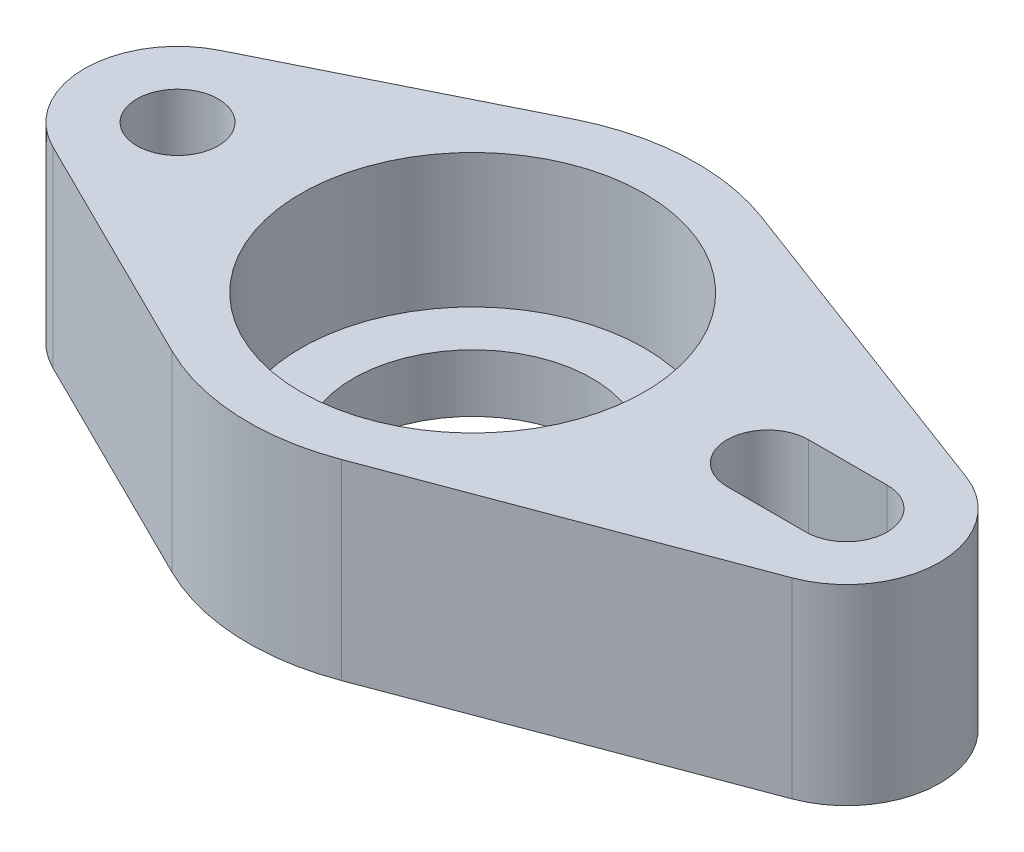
from build123d import *

# Parameters (mm, degrees)
BODY_DEPTH    = 7.3
FLOOR_2_DEPTH = 2.2


with BuildPart() as part:
    # Sketch1 → Body (new body)
    with BuildSketch(Plane(origin=(0, 0, 0), x_dir=(1, 0, 0), z_dir=(0, 1, 0))):
        with BuildLine():
            ThreePointArc((-9.077912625, 2.807941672), (-10.899387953, 3.532643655), (-12.827777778, 3.180112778))
            ThreePointArc((-12.827777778, 3.180112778), (-14.8, 0), (-12.827777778, -3.180112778))
            ThreePointArc((-12.827777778, -3.180112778), (-10.899387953, -3.532643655), (-9.077912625, -2.807941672))
            Line((-9.077912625, -2.807941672), (-11.938888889, -1.388499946))
            ThreePointArc((-11.938888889, -1.388499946), (-12.8, 0), (-11.938888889, 1.388499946))
            Line((-11.938888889, 1.388499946), (-9.077912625, 2.807941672))
        make_face()
        with BuildLine():
            ThreePointArc((-8.313888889, -1.995432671), (-8.429514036, -1.430312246), (-8.506771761, -0.858681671))
            Line((-8.506771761, -0.858681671), (-9.721304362, -0.256104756))
            ThreePointArc((-9.721304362, -0.256104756), (-10.545089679, -1.380435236), (-11.938888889, -1.388499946))
            Line((-11.938888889, -1.388499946), (-9.077912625, -2.807941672))
            ThreePointArc((-9.077912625, -2.807941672), (-8.66379319, -2.431878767), (-8.313888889, -1.995432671))
        make_face()
        with BuildLine():
            ThreePointArc((-8.313888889, 1.995432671), (-8.66379319, 2.431878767), (-9.077912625, 2.807941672))
            Line((-9.077912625, 2.807941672), (-11.938888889, 1.388499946))
            ThreePointArc((-11.938888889, 1.388499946), (-10.433078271, 1.317246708), (-9.7, 0))
            ThreePointArc((-9.7, 0), (-9.705335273, -0.128494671), (-9.721304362, -0.256104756))
            Line((-9.721304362, -0.256104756), (-8.506771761, -0.858681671))
            ThreePointArc((-8.506771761, -0.858681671), (-8.53054209, 0.576499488), (-8.313888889, 1.995432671))
        make_face()
        with BuildLine():
            ThreePointArc((-7.7, 0), (-7.856941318, 1.043864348), (-8.313888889, 1.995432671))
            ThreePointArc((-8.313888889, 1.995432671), (-8.53054209, 0.576499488), (-8.506771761, -0.858681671))
            Line((-8.506771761, -0.858681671), (-7.895540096, -1.1619375))
            ThreePointArc((-7.895540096, -1.1619375), (-7.749226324, -0.589138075), (-7.7, 0))
        make_face()
        with BuildLine():
            ThreePointArc((-8.313888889, -1.995432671), (-8.077225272, -1.592482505), (-7.895540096, -1.1619375))
            Line((-7.895540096, -1.1619375), (-8.506771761, -0.858681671))
            ThreePointArc((-8.506771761, -0.858681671), (-8.429514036, -1.430312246), (-8.313888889, -1.995432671))
        make_face()
        with BuildLine():
            ThreePointArc((-7.7, 0), (-7.856941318, 1.043864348), (-8.313888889, 1.995432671))
            ThreePointArc((-8.313888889, 1.995432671), (-8.53054209, 0.576499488), (-8.506771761, -0.858681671))
            Line((-8.506771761, -0.858681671), (-7.895540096, -1.1619375))
            ThreePointArc((-7.895540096, -1.1619375), (-7.749226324, -0.589138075), (-7.7, 0))
        make_face()
        with BuildLine():
            ThreePointArc((-8.313888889, -1.995432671), (-8.077225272, -1.592482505), (-7.895540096, -1.1619375))
            Line((-7.895540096, -1.1619375), (-8.506771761, -0.858681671))
            ThreePointArc((-8.506771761, -0.858681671), (-8.429514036, -1.430312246), (-8.313888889, -1.995432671))
        make_face()
        with BuildLine():
            Line((-12.827777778, -3.180112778), (-3.8, -7.659144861))
            ThreePointArc((-3.8, -7.659144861), (-6.190242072, -5.897745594), (-7.83397287, -3.425108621))
            Line((-7.83397287, -3.425108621), (-9.077912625, -2.807941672))
            ThreePointArc((-9.077912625, -2.807941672), (-10.899387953, -3.532643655), (-12.827777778, -3.180112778))
        make_face()
        with BuildLine():
            ThreePointArc((-7.83397287, 3.425108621), (-6.190242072, 5.897745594), (-3.8, 7.659144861))
            Line((-3.8, 7.659144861), (-12.827777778, 3.180112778))
            ThreePointArc((-12.827777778, 3.180112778), (-10.899387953, 3.532643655), (-9.077912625, 2.807941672))
            Line((-9.077912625, 2.807941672), (-7.83397287, 3.425108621))
        make_face()
        with BuildLine():
            ThreePointArc((-8.313888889, 1.995432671), (-8.105513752, 2.720872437), (-7.83397287, 3.425108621))
            Line((-7.83397287, 3.425108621), (-9.077912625, 2.807941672))
            ThreePointArc((-9.077912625, 2.807941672), (-8.66379319, 2.431878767), (-8.313888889, 1.995432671))
        make_face()
        with BuildLine():
            Line((-9.077912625, -2.807941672), (-7.83397287, -3.425108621))
            ThreePointArc((-7.83397287, -3.425108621), (-8.105513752, -2.720872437), (-8.313888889, -1.995432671))
            ThreePointArc((-8.313888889, -1.995432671), (-8.66379319, -2.431878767), (-9.077912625, -2.807941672))
        make_face()
        with BuildLine():
            ThreePointArc((-2.911111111, -5.867532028), (-4.972324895, -4.263623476), (-6.242982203, -1.981835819))
            Line((-6.242982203, -1.981835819), (-7.895540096, -1.1619375))
            ThreePointArc((-7.895540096, -1.1619375), (-8.077225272, -1.592482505), (-8.313888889, -1.995432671))
            ThreePointArc((-8.313888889, -1.995432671), (-8.105513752, -2.720872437), (-7.83397287, -3.425108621))
            Line((-7.83397287, -3.425108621), (-2.911111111, -5.867532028))
        make_face()
        with BuildLine():
            ThreePointArc((-6.242982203, -1.981835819), (-6.029303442, 2.559296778), (-2.911111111, 5.867532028))
            Line((-2.911111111, 5.867532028), (-7.83397287, 3.425108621))
            ThreePointArc((-7.83397287, 3.425108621), (-8.105513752, 2.720872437), (-8.313888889, 1.995432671))
            ThreePointArc((-8.313888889, 1.995432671), (-7.856941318, 1.043864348), (-7.7, 0))
            ThreePointArc((-7.7, 0), (-7.749226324, -0.589138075), (-7.895540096, -1.1619375))
            Line((-7.895540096, -1.1619375), (-6.242982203, -1.981835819))
        make_face()
        with BuildLine():
            Line((2.298245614, 6.133560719), (7.444305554, 4.205331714))
            ThreePointArc((7.444305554, 4.205331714), (5.557240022, 6.497659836), (3, 8.006403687))
            ThreePointArc((3, 8.006403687), (-0.436058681, 8.538873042), (-3.8, 7.659144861))
            ThreePointArc((-3.8, 7.659144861), (-6.190242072, 5.897745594), (-7.83397287, 3.425108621))
            Line((-7.83397287, 3.425108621), (-2.911111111, 5.867532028))
            ThreePointArc((-2.911111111, 5.867532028), (-0.33405665, 6.541475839), (2.298245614, 6.133560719))
        make_face()
        with BuildLine():
            Line((6.008616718, 2.607494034), (8.185401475, 1.791852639))
            ThreePointArc((8.185401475, 1.791852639), (8.247919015, 1.894732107), (8.313888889, 1.995432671))
            ThreePointArc((8.313888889, 1.995432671), (7.956197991, 3.130720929), (7.444305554, 4.205331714))
            Line((7.444305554, 4.205331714), (2.298245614, 6.133560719))
            ThreePointArc((2.298245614, 6.133560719), (4.512125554, 4.747970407), (6.008616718, 2.607494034))
        make_face()
        with BuildLine():
            ThreePointArc((8.313888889, -1.995432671), (7.702041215, -0.120368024), (8.185401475, 1.791852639))
            Line((8.185401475, 1.791852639), (6.008616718, 2.607494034))
            ThreePointArc((6.008616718, 2.607494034), (6.413226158, 1.33155182), (6.55, 0))
            ThreePointArc((6.55, 0), (5.383122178, -3.731554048), (2.298245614, -6.133560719))
            Line((2.298245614, -6.133560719), (7.444305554, -4.205331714))
            ThreePointArc((7.444305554, -4.205331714), (7.956197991, -3.130720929), (8.313888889, -1.995432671))
        make_face()
        with BuildLine():
            ThreePointArc((3, -8.006403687), (5.557240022, -6.497659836), (7.444305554, -4.205331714))
            Line((7.444305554, -4.205331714), (2.298245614, -6.133560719))
            ThreePointArc((2.298245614, -6.133560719), (-0.33405665, -6.541475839), (-2.911111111, -5.867532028))
            Line((-2.911111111, -5.867532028), (-7.83397287, -3.425108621))
            ThreePointArc((-7.83397287, -3.425108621), (-6.190242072, -5.897745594), (-3.8, -7.659144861))
            ThreePointArc((-3.8, -7.659144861), (-0.436058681, -8.538873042), (3, -8.006403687))
        make_face()
        with BuildLine():
            ThreePointArc((11.25, -3.55), (10.563230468, -3.482936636), (9.902408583, -3.284280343))
            Line((9.902408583, -3.284280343), (7.444305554, -4.205331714))
            ThreePointArc((7.444305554, -4.205331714), (5.557240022, -6.497659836), (3, -8.006403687))
            Line((3, -8.006403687), (15.495614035, -3.324296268))
            ThreePointArc((15.495614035, -3.324296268), (14.882948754, -3.49311836), (14.25, -3.55))
            Line((14.25, -3.55), (11.25, -3.55))
        make_face()
        with BuildLine():
            Line((7.444305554, -4.205331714), (9.902408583, -3.284280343))
            ThreePointArc((9.902408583, -3.284280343), (9.013304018, -2.756753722), (8.313888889, -1.995432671))
            ThreePointArc((8.313888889, -1.995432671), (7.956197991, -3.130720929), (7.444305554, -4.205331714))
        make_face()
        with BuildLine():
            ThreePointArc((8.55, 0), (8.506148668, 0.864832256), (8.375044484, 1.720793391))
            Line((8.375044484, 1.720793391), (8.185401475, 1.791852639))
            ThreePointArc((8.185401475, 1.791852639), (7.702041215, -0.120368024), (8.313888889, -1.995432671))
            ThreePointArc((8.313888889, -1.995432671), (8.490767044, -1.004676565), (8.55, 0))
        make_face()
        with BuildLine():
            Line((8.185401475, 1.791852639), (8.375044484, 1.720793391))
            ThreePointArc((8.375044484, 1.720793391), (8.345596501, 1.858364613), (8.313888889, 1.995432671))
            ThreePointArc((8.313888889, 1.995432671), (8.247919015, 1.894732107), (8.185401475, 1.791852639))
        make_face()
        with BuildLine():
            ThreePointArc((8.55, 0), (8.506148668, 0.864832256), (8.375044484, 1.720793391))
            Line((8.375044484, 1.720793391), (8.185401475, 1.791852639))
            ThreePointArc((8.185401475, 1.791852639), (7.702041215, -0.120368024), (8.313888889, -1.995432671))
            ThreePointArc((8.313888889, -1.995432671), (8.490767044, -1.004676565), (8.55, 0))
        make_face()
        with BuildLine():
            Line((8.185401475, 1.791852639), (8.375044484, 1.720793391))
            ThreePointArc((8.375044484, 1.720793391), (8.345596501, 1.858364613), (8.313888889, 1.995432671))
            ThreePointArc((8.313888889, 1.995432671), (8.247919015, 1.894732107), (8.185401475, 1.791852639))
        make_face()
        with BuildLine():
            ThreePointArc((8.313888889, 1.995432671), (9.013304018, 2.756753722), (9.902408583, 3.284280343))
            Line((9.902408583, 3.284280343), (7.444305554, 4.205331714))
            ThreePointArc((7.444305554, 4.205331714), (7.956197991, 3.130720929), (8.313888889, 1.995432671))
        make_face()
        with BuildLine():
            ThreePointArc((10.12419023, 1.065388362), (10.637159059, 1.423701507), (11.25, 1.55))
            Line((11.25, 1.55), (14.25, 1.55))
            ThreePointArc((14.25, 1.55), (14.526357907, 1.525164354), (14.793859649, 1.4514533))
            Line((14.793859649, 1.4514533), (9.902408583, 3.284280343))
            ThreePointArc((9.902408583, 3.284280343), (9.013304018, 2.756753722), (8.313888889, 1.995432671))
            ThreePointArc((8.313888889, 1.995432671), (8.345596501, 1.858364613), (8.375044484, 1.720793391))
            Line((8.375044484, 1.720793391), (10.12419023, 1.065388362))
        make_face()
        with BuildLine():
            ThreePointArc((11.25, -1.55), (9.826298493, -0.612840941), (10.12419023, 1.065388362))
            Line((10.12419023, 1.065388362), (8.375044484, 1.720793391))
            ThreePointArc((8.375044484, 1.720793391), (8.506148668, 0.864832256), (8.55, 0))
            ThreePointArc((8.55, 0), (8.490767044, -1.004676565), (8.313888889, -1.995432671))
            ThreePointArc((8.313888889, -1.995432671), (9.013304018, -2.756753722), (9.902408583, -3.284280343))
            Line((9.902408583, -3.284280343), (14.793859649, -1.4514533))
            ThreePointArc((14.793859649, -1.4514533), (14.526357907, -1.525164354), (14.25, -1.55))
            Line((14.25, -1.55), (11.25, -1.55))
        make_face()
        with BuildLine():
            Line((9.902408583, 3.284280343), (14.793859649, 1.4514533))
            ThreePointArc((14.793859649, 1.4514533), (15.8, 0), (14.793859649, -1.4514533))
            Line((14.793859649, -1.4514533), (9.902408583, -3.284280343))
            ThreePointArc((9.902408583, -3.284280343), (10.563230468, -3.482936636), (11.25, -3.55))
            Line((11.25, -3.55), (14.25, -3.55))
            ThreePointArc((14.25, -3.55), (14.882948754, -3.49311836), (15.495614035, -3.324296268))
            ThreePointArc((15.495614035, -3.324296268), (17.8, 0), (15.495614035, 3.324296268))
            ThreePointArc((15.495614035, 3.324296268), (14.882948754, 3.49311836), (14.25, 3.55))
            Line((14.25, 3.55), (11.25, 3.55))
            ThreePointArc((11.25, 3.55), (10.563230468, 3.482936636), (9.902408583, 3.284280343))
        make_face()
        with BuildLine():
            Line((7.444305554, 4.205331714), (9.902408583, 3.284280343))
            ThreePointArc((9.902408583, 3.284280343), (10.563230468, 3.482936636), (11.25, 3.55))
            Line((11.25, 3.55), (14.25, 3.55))
            ThreePointArc((14.25, 3.55), (14.882948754, 3.49311836), (15.495614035, 3.324296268))
            Line((15.495614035, 3.324296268), (3, 8.006403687))
            ThreePointArc((3, 8.006403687), (5.557240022, 6.497659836), (7.444305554, 4.205331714))
        make_face()
    extrude(amount=BODY_DEPTH)

    # Sketch1_4 → Floor 2 (add)
    with BuildSketch(Plane(origin=(0, 0, 0), x_dir=(1, 0, 0), z_dir=(0, 1, 0))):
        with BuildLine():
            ThreePointArc((6.55, 0), (6.413226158, 1.33155182), (6.008616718, 2.607494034))
            Line((6.008616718, 2.607494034), (1.596491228, 4.260717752))
            ThreePointArc((1.596491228, 4.260717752), (3.73942075, 2.592148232), (4.55, 0))
            ThreePointArc((4.55, 0), (2.398060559, -3.866756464), (-2.022222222, -4.075919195))
            Line((-2.022222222, -4.075919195), (-6.242982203, -1.981835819))
            ThreePointArc((-6.242982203, -1.981835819), (-4.972324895, -4.263623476), (-2.911111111, -5.867532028))
            ThreePointArc((-2.911111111, -5.867532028), (-0.33405665, -6.541475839), (2.298245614, -6.133560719))
            ThreePointArc((2.298245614, -6.133560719), (5.383122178, -3.731554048), (6.55, 0))
        make_face()
        with BuildLine():
            Line((1.596491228, 4.260717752), (6.008616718, 2.607494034))
            ThreePointArc((6.008616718, 2.607494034), (4.512125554, 4.747970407), (2.298245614, 6.133560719))
            ThreePointArc((2.298245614, 6.133560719), (-0.33405665, 6.541475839), (-2.911111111, 5.867532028))
            ThreePointArc((-2.911111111, 5.867532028), (-6.029303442, 2.559296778), (-6.242982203, -1.981835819))
            Line((-6.242982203, -1.981835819), (-2.022222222, -4.075919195))
            ThreePointArc((-2.022222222, -4.075919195), (-4.173750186, 1.811714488), (1.596491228, 4.260717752))
        make_face()
        with BuildLine():
            ThreePointArc((6.55, 0), (6.413226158, 1.33155182), (6.008616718, 2.607494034))
            Line((6.008616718, 2.607494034), (1.596491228, 4.260717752))
            ThreePointArc((1.596491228, 4.260717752), (3.73942075, 2.592148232), (4.55, 0))
            ThreePointArc((4.55, 0), (2.398060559, -3.866756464), (-2.022222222, -4.075919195))
            Line((-2.022222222, -4.075919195), (-6.242982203, -1.981835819))
            ThreePointArc((-6.242982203, -1.981835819), (-4.972324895, -4.263623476), (-2.911111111, -5.867532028))
            ThreePointArc((-2.911111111, -5.867532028), (-0.33405665, -6.541475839), (2.298245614, -6.133560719))
            ThreePointArc((2.298245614, -6.133560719), (5.383122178, -3.731554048), (6.55, 0))
        make_face()
        with BuildLine():
            Line((1.596491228, 4.260717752), (6.008616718, 2.607494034))
            ThreePointArc((6.008616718, 2.607494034), (4.512125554, 4.747970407), (2.298245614, 6.133560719))
            ThreePointArc((2.298245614, 6.133560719), (-0.33405665, 6.541475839), (-2.911111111, 5.867532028))
            ThreePointArc((-2.911111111, 5.867532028), (-6.029303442, 2.559296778), (-6.242982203, -1.981835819))
            Line((-6.242982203, -1.981835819), (-2.022222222, -4.075919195))
            ThreePointArc((-2.022222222, -4.075919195), (-4.173750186, 1.811714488), (1.596491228, 4.260717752))
        make_face()
    extrude(amount=FLOOR_2_DEPTH)


solid = part.part
